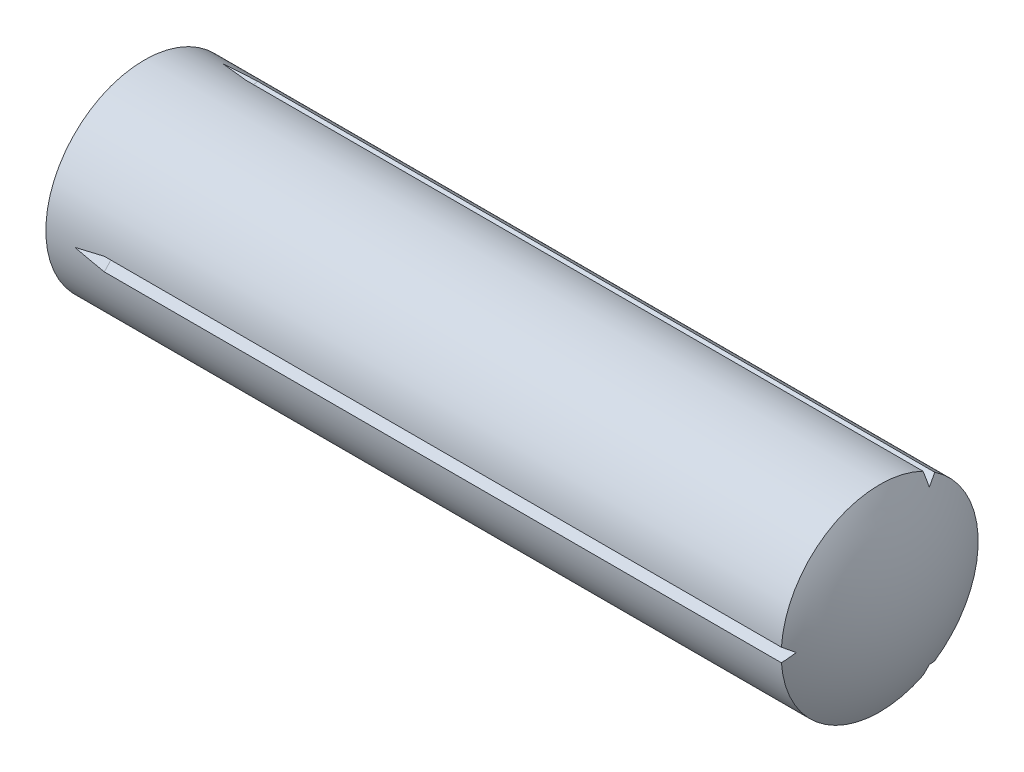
from build123d import *

# Parameters (mm, degrees)
CIRPATTERN1_COUNT = 3


with BuildPart() as part:
    # Sketch1 → Base-Revolve (revolve)
    with BuildSketch(Plane.XY):
        with BuildLine():
            Line((-100, 0), (-100, 1.25))
            ThreePointArc((-100, 1.25), (-99.010050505, 7.072345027), (-96.68190465, 12.5))
            Line((-96.68190465, 12.5), (-3.349364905, 12.5))
            ThreePointArc((-3.349364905, 12.5), (-0.851854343, 6.470476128), (0, 0))
            Line((0, 0), (-100, 0))
        make_face()
    revolve(axis=Axis((-117, 0, 0), (1, 0, 0)))

    # Cut-Sweep1: sweep along a path in Sketch4
    with BuildLine(Plane(origin=(0, 0, 0), x_dir=(1, 0, 0), z_dir=(0, 1, 0))) as cut_sweep1_path:
        Line((0, -11.25), (-89.5, -11.25))
        Line((-89.5, -11.25), (-93, -12.5))
    # Sketch2 → Cut-Sweep1 (sweep, cut)
    with BuildSketch(Plane(origin=(0, 0, 0), x_dir=(0, 0, -1), z_dir=(1, 0, 0))):
        Polygon((-11.25, 0), (-12.5, 0.875259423), (-12.5, -0.875259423), align=None)
    cut_sweep1 = sweep(path=cut_sweep1_path.line, transition=Transition.RIGHT, mode=Mode.SUBTRACT)

    # CirPattern1: Cut-Sweep1 ×3 about axis
    cirpattern1_axis = Axis((0, 0, 0), (1, 0, 0))
    for i in range(1, CIRPATTERN1_COUNT):
        add(cut_sweep1.rotate(cirpattern1_axis, i * 360 / CIRPATTERN1_COUNT), mode=Mode.SUBTRACT)


solid = part.part
